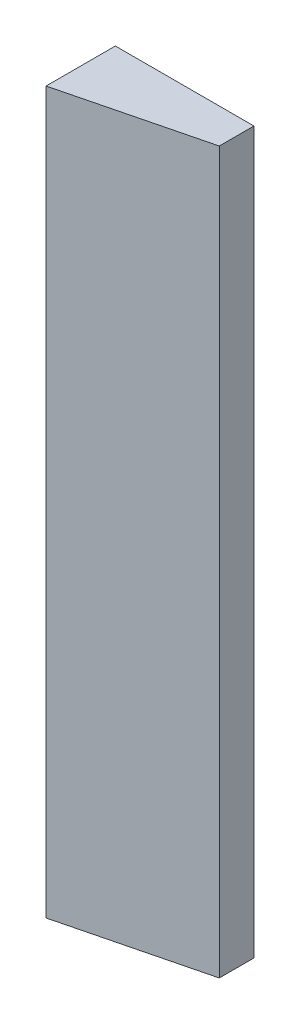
ISO-10303-21;
HEADER;
FILE_DESCRIPTION(('STEP AP214'),'2;1');
FILE_NAME('part.step','',(''),(''),'','','');
FILE_SCHEMA(('AUTOMOTIVE_DESIGN { 1 0 10303 214 1 1 1 1 }'));
ENDSEC;
DATA;
#1=APPLICATION_CONTEXT('core data for automotive mechanical design processes');
#2=APPLICATION_PROTOCOL_DEFINITION('international standard','automotive_design',2000,#1);
#3=PRODUCT_CONTEXT('',#1,'mechanical');
#4=PRODUCT('Part','Part','',(#3));
#5=PRODUCT_RELATED_PRODUCT_CATEGORY('part','',(#4));
#6=PRODUCT_DEFINITION_FORMATION('','',#4);
#7=PRODUCT_DEFINITION_CONTEXT('part definition',#1,'design');
#8=PRODUCT_DEFINITION('design','',#6,#7);
#9=PRODUCT_DEFINITION_SHAPE('','',#8);
#10=(LENGTH_UNIT() NAMED_UNIT(*) SI_UNIT(.MILLI.,.METRE.));
#11=(NAMED_UNIT(*) PLANE_ANGLE_UNIT() SI_UNIT($,.RADIAN.));
#12=(NAMED_UNIT(*) SI_UNIT($,.STERADIAN.) SOLID_ANGLE_UNIT());
#13=UNCERTAINTY_MEASURE_WITH_UNIT(LENGTH_MEASURE(1.E-05),#10,'distance_accuracy_value','');
#14=(GEOMETRIC_REPRESENTATION_CONTEXT(3) GLOBAL_UNCERTAINTY_ASSIGNED_CONTEXT((#13)) GLOBAL_UNIT_ASSIGNED_CONTEXT((#10,
#11,#12)) REPRESENTATION_CONTEXT('',''));
#15=CARTESIAN_POINT('',(0.,0.,0.));
#16=DIRECTION('',(0.,0.,1.));
#17=DIRECTION('',(1.,0.,0.));
#18=AXIS2_PLACEMENT_3D('',#15,#16,#17);
#19=CARTESIAN_POINT('',(63.5000000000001,0.,0.));
#20=DIRECTION('',(1.,0.,0.));
#21=DIRECTION('',(0.,0.,-1.));
#22=AXIS2_PLACEMENT_3D('',#19,#20,#21);
#23=PLANE('',#22);
#24=DIRECTION('',(0.,0.,-1.));
#25=VECTOR('',#24,1.);
#26=CARTESIAN_POINT('',(63.5000000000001,-165.1,-142.875));
#27=LINE('',#26,#25);
#28=CARTESIAN_POINT('',(63.5000000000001,-165.1,-142.875));
#29=VERTEX_POINT('',#28);
#30=CARTESIAN_POINT('',(63.5000000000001,-165.1,-158.75));
#31=VERTEX_POINT('',#30);
#32=EDGE_CURVE('E245',#29,#31,#27,.T.);
#33=ORIENTED_EDGE('',*,*,#32,.T.);
#34=DIRECTION('',(0.,1.,0.));
#35=VECTOR('',#34,1.);
#36=CARTESIAN_POINT('',(63.5000000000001,-165.1,-158.75));
#37=LINE('',#36,#35);
#38=CARTESIAN_POINT('',(63.5000000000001,165.1,-158.75));
#39=VERTEX_POINT('',#38);
#40=EDGE_CURVE('E126',#31,#39,#37,.T.);
#41=ORIENTED_EDGE('',*,*,#40,.T.);
#42=DIRECTION('',(0.,0.,1.));
#43=VECTOR('',#42,1.);
#44=CARTESIAN_POINT('',(63.5000000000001,165.1,-158.75));
#45=LINE('',#44,#43);
#46=CARTESIAN_POINT('',(63.5000000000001,165.1,-142.875));
#47=VERTEX_POINT('',#46);
#48=EDGE_CURVE('E64',#39,#47,#45,.T.);
#49=ORIENTED_EDGE('',*,*,#48,.T.);
#50=DIRECTION('',(0.,-1.,0.));
#51=VECTOR('',#50,1.);
#52=CARTESIAN_POINT('',(63.5000000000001,165.1,-142.875));
#53=LINE('',#52,#51);
#54=EDGE_CURVE('E12',#47,#29,#53,.T.);
#55=ORIENTED_EDGE('',*,*,#54,.T.);
#56=EDGE_LOOP('',(#33,#41,#49,#55));
#57=FACE_BOUND('',#56,.T.);
#58=ADVANCED_FACE('F52',(#57),#23,.T.);
#59=CARTESIAN_POINT('',(0.,0.,0.));
#60=DIRECTION('',(1.,0.,0.));
#61=DIRECTION('',(0.,0.,-1.));
#62=AXIS2_PLACEMENT_3D('',#59,#60,#61);
#63=PLANE('',#62);
#64=DIRECTION('',(0.,0.,-1.));
#65=VECTOR('',#64,1.);
#66=CARTESIAN_POINT('',(0.,-165.1,-127.));
#67=LINE('',#66,#65);
#68=CARTESIAN_POINT('',(0.,-165.1,-127.));
#69=VERTEX_POINT('',#68);
#70=CARTESIAN_POINT('',(0.,-165.1,-158.75));
#71=VERTEX_POINT('',#70);
#72=EDGE_CURVE('E105',#69,#71,#67,.T.);
#73=ORIENTED_EDGE('',*,*,#72,.F.);
#74=DIRECTION('',(0.,-1.,0.));
#75=VECTOR('',#74,1.);
#76=CARTESIAN_POINT('',(0.,165.1,-127.));
#77=LINE('',#76,#75);
#78=CARTESIAN_POINT('',(0.,165.1,-127.));
#79=VERTEX_POINT('',#78);
#80=EDGE_CURVE('E132',#79,#69,#77,.T.);
#81=ORIENTED_EDGE('',*,*,#80,.F.);
#82=DIRECTION('',(0.,0.,1.));
#83=VECTOR('',#82,1.);
#84=CARTESIAN_POINT('',(0.,165.1,-158.75));
#85=LINE('',#84,#83);
#86=CARTESIAN_POINT('',(0.,165.1,-158.75));
#87=VERTEX_POINT('',#86);
#88=EDGE_CURVE('E102',#87,#79,#85,.T.);
#89=ORIENTED_EDGE('',*,*,#88,.F.);
#90=DIRECTION('',(0.,1.,0.));
#91=VECTOR('',#90,1.);
#92=CARTESIAN_POINT('',(0.,-165.1,-158.75));
#93=LINE('',#92,#91);
#94=EDGE_CURVE('E98',#71,#87,#93,.T.);
#95=ORIENTED_EDGE('',*,*,#94,.F.);
#96=EDGE_LOOP('',(#73,#81,#89,#95));
#97=FACE_BOUND('',#96,.T.);
#98=ADVANCED_FACE('F101',(#97),#63,.F.);
#99=CARTESIAN_POINT('',(0.,-165.1,0.));
#100=DIRECTION('',(0.,1.,0.));
#101=DIRECTION('',(0.,0.,1.));
#102=AXIS2_PLACEMENT_3D('',#99,#100,#101);
#103=PLANE('',#102);
#104=DIRECTION('',(1.,0.,0.));
#105=VECTOR('',#104,1.);
#106=CARTESIAN_POINT('',(0.,-165.1,-158.75));
#107=LINE('',#106,#105);
#108=EDGE_CURVE('E116',#71,#31,#107,.T.);
#109=ORIENTED_EDGE('',*,*,#108,.T.);
#110=ORIENTED_EDGE('',*,*,#32,.F.);
#111=DIRECTION('',(0.970142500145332,0.,-0.242535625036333));
#112=VECTOR('',#111,1.);
#113=CARTESIAN_POINT('',(0.,-165.1,-127.));
#114=LINE('',#113,#112);
#115=EDGE_CURVE('E124',#69,#29,#114,.T.);
#116=ORIENTED_EDGE('',*,*,#115,.F.);
#117=ORIENTED_EDGE('',*,*,#72,.T.);
#118=EDGE_LOOP('',(#109,#110,#116,#117));
#119=FACE_BOUND('',#118,.T.);
#120=ADVANCED_FACE('F119',(#119),#103,.F.);
#121=CARTESIAN_POINT('',(-29.8823529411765,0.,-119.529411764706));
#122=DIRECTION('',(-0.242535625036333,0.,-0.970142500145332));
#123=DIRECTION('',(-0.970142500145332,0.,0.242535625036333));
#124=AXIS2_PLACEMENT_3D('',#121,#122,#123);
#125=PLANE('',#124);
#126=ORIENTED_EDGE('',*,*,#115,.T.);
#127=ORIENTED_EDGE('',*,*,#54,.F.);
#128=DIRECTION('',(0.970142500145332,0.,-0.242535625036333));
#129=VECTOR('',#128,1.);
#130=CARTESIAN_POINT('',(0.,165.1,-127.));
#131=LINE('',#130,#129);
#132=EDGE_CURVE('E79',#79,#47,#131,.T.);
#133=ORIENTED_EDGE('',*,*,#132,.F.);
#134=ORIENTED_EDGE('',*,*,#80,.T.);
#135=EDGE_LOOP('',(#126,#127,#133,#134));
#136=FACE_BOUND('',#135,.T.);
#137=ADVANCED_FACE('F157',(#136),#125,.F.);
#138=CARTESIAN_POINT('',(0.,0.,-158.75));
#139=DIRECTION('',(0.,0.,1.));
#140=DIRECTION('',(1.,0.,0.));
#141=AXIS2_PLACEMENT_3D('',#138,#139,#140);
#142=PLANE('',#141);
#143=DIRECTION('',(1.,0.,0.));
#144=VECTOR('',#143,1.);
#145=CARTESIAN_POINT('',(0.,165.1,-158.75));
#146=LINE('',#145,#144);
#147=EDGE_CURVE('E137',#87,#39,#146,.T.);
#148=ORIENTED_EDGE('',*,*,#147,.T.);
#149=ORIENTED_EDGE('',*,*,#40,.F.);
#150=ORIENTED_EDGE('',*,*,#108,.F.);
#151=ORIENTED_EDGE('',*,*,#94,.T.);
#152=EDGE_LOOP('',(#148,#149,#150,#151));
#153=FACE_BOUND('',#152,.T.);
#154=ADVANCED_FACE('F127',(#153),#142,.F.);
#155=CARTESIAN_POINT('',(0.,165.1,0.));
#156=DIRECTION('',(0.,-1.,0.));
#157=DIRECTION('',(0.,0.,-1.));
#158=AXIS2_PLACEMENT_3D('',#155,#156,#157);
#159=PLANE('',#158);
#160=ORIENTED_EDGE('',*,*,#132,.T.);
#161=ORIENTED_EDGE('',*,*,#48,.F.);
#162=ORIENTED_EDGE('',*,*,#147,.F.);
#163=ORIENTED_EDGE('',*,*,#88,.T.);
#164=EDGE_LOOP('',(#160,#161,#162,#163));
#165=FACE_BOUND('',#164,.T.);
#166=ADVANCED_FACE('F158',(#165),#159,.F.);
#167=CLOSED_SHELL('',(#58,#98,#120,#137,#154,#166));
#168=MANIFOLD_SOLID_BREP('B2',#167);
#169=ADVANCED_BREP_SHAPE_REPRESENTATION('',(#18,#168),#14);
#170=SHAPE_DEFINITION_REPRESENTATION(#9,#169);
ENDSEC;
END-ISO-10303-21;
